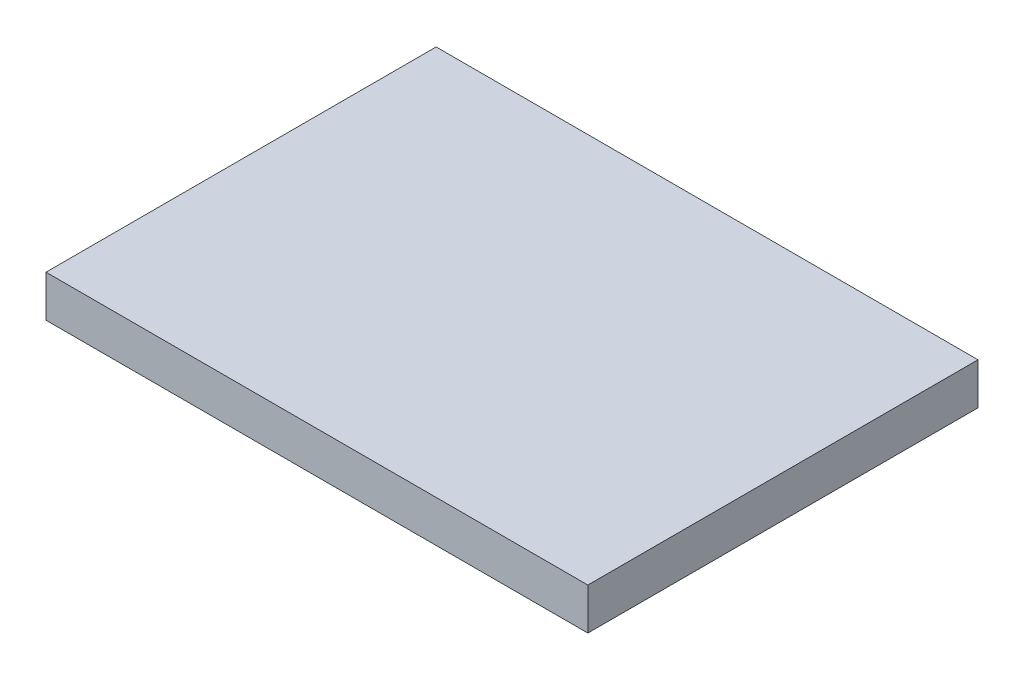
ISO-10303-21;
HEADER;
FILE_DESCRIPTION(('STEP AP214'),'2;1');
FILE_NAME('part.step','',(''),(''),'','','');
FILE_SCHEMA(('AUTOMOTIVE_DESIGN { 1 0 10303 214 1 1 1 1 }'));
ENDSEC;
DATA;
#1=APPLICATION_CONTEXT('core data for automotive mechanical design processes');
#2=APPLICATION_PROTOCOL_DEFINITION('international standard','automotive_design',2000,#1);
#3=PRODUCT_CONTEXT('',#1,'mechanical');
#4=PRODUCT('Part','Part','',(#3));
#5=PRODUCT_RELATED_PRODUCT_CATEGORY('part','',(#4));
#6=PRODUCT_DEFINITION_FORMATION('','',#4);
#7=PRODUCT_DEFINITION_CONTEXT('part definition',#1,'design');
#8=PRODUCT_DEFINITION('design','',#6,#7);
#9=PRODUCT_DEFINITION_SHAPE('','',#8);
#10=(LENGTH_UNIT() NAMED_UNIT(*) SI_UNIT(.MILLI.,.METRE.));
#11=(NAMED_UNIT(*) PLANE_ANGLE_UNIT() SI_UNIT($,.RADIAN.));
#12=(NAMED_UNIT(*) SI_UNIT($,.STERADIAN.) SOLID_ANGLE_UNIT());
#13=UNCERTAINTY_MEASURE_WITH_UNIT(LENGTH_MEASURE(1.E-05),#10,'distance_accuracy_value','');
#14=(GEOMETRIC_REPRESENTATION_CONTEXT(3) GLOBAL_UNCERTAINTY_ASSIGNED_CONTEXT((#13)) GLOBAL_UNIT_ASSIGNED_CONTEXT((#10,
#11,#12)) REPRESENTATION_CONTEXT('',''));
#15=CARTESIAN_POINT('',(0.,0.,0.));
#16=DIRECTION('',(0.,0.,1.));
#17=DIRECTION('',(1.,0.,0.));
#18=AXIS2_PLACEMENT_3D('',#15,#16,#17);
#19=CARTESIAN_POINT('',(7.9375,-1.2192,-5.715));
#20=DIRECTION('',(1.,0.,0.));
#21=DIRECTION('',(0.,0.,-1.));
#22=AXIS2_PLACEMENT_3D('',#19,#20,#21);
#23=PLANE('',#22);
#24=DIRECTION('',(0.,0.,-1.));
#25=VECTOR('',#24,1.);
#26=CARTESIAN_POINT('',(7.9375,0.,-5.715));
#27=LINE('',#26,#25);
#28=CARTESIAN_POINT('',(7.9375,0.,5.715));
#29=VERTEX_POINT('',#28);
#30=CARTESIAN_POINT('',(7.9375,0.,-5.715));
#31=VERTEX_POINT('',#30);
#32=EDGE_CURVE('E104',#29,#31,#27,.T.);
#33=ORIENTED_EDGE('',*,*,#32,.F.);
#34=DIRECTION('',(0.,1.,0.));
#35=VECTOR('',#34,1.);
#36=CARTESIAN_POINT('',(7.9375,-1.2192,5.715));
#37=LINE('',#36,#35);
#38=CARTESIAN_POINT('',(7.9375,-1.2192,5.715));
#39=VERTEX_POINT('',#38);
#40=EDGE_CURVE('E11',#39,#29,#37,.T.);
#41=ORIENTED_EDGE('',*,*,#40,.F.);
#42=DIRECTION('',(0.,0.,-1.));
#43=VECTOR('',#42,1.);
#44=CARTESIAN_POINT('',(7.9375,-1.2192,-5.715));
#45=LINE('',#44,#43);
#46=CARTESIAN_POINT('',(7.9375,-1.2192,-5.715));
#47=VERTEX_POINT('',#46);
#48=EDGE_CURVE('E98',#39,#47,#45,.T.);
#49=ORIENTED_EDGE('',*,*,#48,.T.);
#50=DIRECTION('',(0.,1.,0.));
#51=VECTOR('',#50,1.);
#52=CARTESIAN_POINT('',(7.9375,-1.2192,-5.715));
#53=LINE('',#52,#51);
#54=EDGE_CURVE('E43',#47,#31,#53,.T.);
#55=ORIENTED_EDGE('',*,*,#54,.T.);
#56=EDGE_LOOP('',(#33,#41,#49,#55));
#57=FACE_BOUND('',#56,.T.);
#58=ADVANCED_FACE('F40',(#57),#23,.T.);
#59=CARTESIAN_POINT('',(-7.9375,-1.2192,5.715));
#60=DIRECTION('',(0.,0.,1.));
#61=DIRECTION('',(1.,0.,0.));
#62=AXIS2_PLACEMENT_3D('',#59,#60,#61);
#63=PLANE('',#62);
#64=DIRECTION('',(1.,0.,0.));
#65=VECTOR('',#64,1.);
#66=CARTESIAN_POINT('',(-7.9375,0.,5.715));
#67=LINE('',#66,#65);
#68=CARTESIAN_POINT('',(-7.9375,0.,5.715));
#69=VERTEX_POINT('',#68);
#70=EDGE_CURVE('E100',#69,#29,#67,.T.);
#71=ORIENTED_EDGE('',*,*,#70,.F.);
#72=DIRECTION('',(0.,1.,0.));
#73=VECTOR('',#72,1.);
#74=CARTESIAN_POINT('',(-7.9375,-1.2192,5.715));
#75=LINE('',#74,#73);
#76=CARTESIAN_POINT('',(-7.9375,-1.2192,5.715));
#77=VERTEX_POINT('',#76);
#78=EDGE_CURVE('E49',#77,#69,#75,.T.);
#79=ORIENTED_EDGE('',*,*,#78,.F.);
#80=DIRECTION('',(1.,0.,0.));
#81=VECTOR('',#80,1.);
#82=CARTESIAN_POINT('',(-7.9375,-1.2192,5.715));
#83=LINE('',#82,#81);
#84=EDGE_CURVE('E95',#77,#39,#83,.T.);
#85=ORIENTED_EDGE('',*,*,#84,.T.);
#86=ORIENTED_EDGE('',*,*,#40,.T.);
#87=EDGE_LOOP('',(#71,#79,#85,#86));
#88=FACE_BOUND('',#87,.T.);
#89=ADVANCED_FACE('F114',(#88),#63,.T.);
#90=CARTESIAN_POINT('',(-7.9375,-1.2192,-5.715));
#91=DIRECTION('',(-1.,0.,0.));
#92=DIRECTION('',(0.,0.,1.));
#93=AXIS2_PLACEMENT_3D('',#90,#91,#92);
#94=PLANE('',#93);
#95=DIRECTION('',(0.,0.,1.));
#96=VECTOR('',#95,1.);
#97=CARTESIAN_POINT('',(-7.9375,0.,-5.715));
#98=LINE('',#97,#96);
#99=CARTESIAN_POINT('',(-7.9375,0.,-5.715));
#100=VERTEX_POINT('',#99);
#101=EDGE_CURVE('E90',#100,#69,#98,.T.);
#102=ORIENTED_EDGE('',*,*,#101,.F.);
#103=DIRECTION('',(0.,1.,0.));
#104=VECTOR('',#103,1.);
#105=CARTESIAN_POINT('',(-7.9375,-1.2192,-5.715));
#106=LINE('',#105,#104);
#107=CARTESIAN_POINT('',(-7.9375,-1.2192,-5.715));
#108=VERTEX_POINT('',#107);
#109=EDGE_CURVE('E85',#108,#100,#106,.T.);
#110=ORIENTED_EDGE('',*,*,#109,.F.);
#111=DIRECTION('',(0.,0.,1.));
#112=VECTOR('',#111,1.);
#113=CARTESIAN_POINT('',(-7.9375,-1.2192,-5.715));
#114=LINE('',#113,#112);
#115=EDGE_CURVE('E88',#108,#77,#114,.T.);
#116=ORIENTED_EDGE('',*,*,#115,.T.);
#117=ORIENTED_EDGE('',*,*,#78,.T.);
#118=EDGE_LOOP('',(#102,#110,#116,#117));
#119=FACE_BOUND('',#118,.T.);
#120=ADVANCED_FACE('F87',(#119),#94,.T.);
#121=CARTESIAN_POINT('',(-7.9375,-1.2192,-5.715));
#122=DIRECTION('',(0.,0.,-1.));
#123=DIRECTION('',(-1.,0.,0.));
#124=AXIS2_PLACEMENT_3D('',#121,#122,#123);
#125=PLANE('',#124);
#126=DIRECTION('',(-1.,0.,0.));
#127=VECTOR('',#126,1.);
#128=CARTESIAN_POINT('',(-7.9375,0.,-5.715));
#129=LINE('',#128,#127);
#130=EDGE_CURVE('E107',#31,#100,#129,.T.);
#131=ORIENTED_EDGE('',*,*,#130,.F.);
#132=ORIENTED_EDGE('',*,*,#54,.F.);
#133=DIRECTION('',(-1.,0.,0.));
#134=VECTOR('',#133,1.);
#135=CARTESIAN_POINT('',(-7.9375,-1.2192,-5.715));
#136=LINE('',#135,#134);
#137=EDGE_CURVE('E94',#47,#108,#136,.T.);
#138=ORIENTED_EDGE('',*,*,#137,.T.);
#139=ORIENTED_EDGE('',*,*,#109,.T.);
#140=EDGE_LOOP('',(#131,#132,#138,#139));
#141=FACE_BOUND('',#140,.T.);
#142=ADVANCED_FACE('F97',(#141),#125,.T.);
#143=CARTESIAN_POINT('',(0.,-1.2192,0.));
#144=DIRECTION('',(0.,1.,0.));
#145=DIRECTION('',(0.,0.,1.));
#146=AXIS2_PLACEMENT_3D('',#143,#144,#145);
#147=PLANE('',#146);
#148=ORIENTED_EDGE('',*,*,#48,.F.);
#149=ORIENTED_EDGE('',*,*,#84,.F.);
#150=ORIENTED_EDGE('',*,*,#115,.F.);
#151=ORIENTED_EDGE('',*,*,#137,.F.);
#152=EDGE_LOOP('',(#148,#149,#150,#151));
#153=FACE_BOUND('',#152,.T.);
#154=ADVANCED_FACE('F93',(#153),#147,.F.);
#155=CARTESIAN_POINT('',(0.,0.,0.));
#156=DIRECTION('',(0.,1.,0.));
#157=DIRECTION('',(0.,0.,1.));
#158=AXIS2_PLACEMENT_3D('',#155,#156,#157);
#159=PLANE('',#158);
#160=ORIENTED_EDGE('',*,*,#32,.T.);
#161=ORIENTED_EDGE('',*,*,#130,.T.);
#162=ORIENTED_EDGE('',*,*,#101,.T.);
#163=ORIENTED_EDGE('',*,*,#70,.T.);
#164=EDGE_LOOP('',(#160,#161,#162,#163));
#165=FACE_BOUND('',#164,.T.);
#166=ADVANCED_FACE('F113',(#165),#159,.T.);
#167=CLOSED_SHELL('',(#58,#89,#120,#142,#154,#166));
#168=MANIFOLD_SOLID_BREP('B2',#167);
#169=ADVANCED_BREP_SHAPE_REPRESENTATION('',(#18,#168),#14);
#170=SHAPE_DEFINITION_REPRESENTATION(#9,#169);
ENDSEC;
END-ISO-10303-21;
